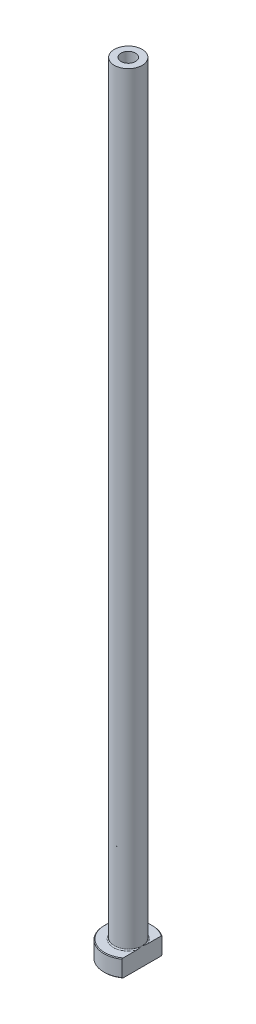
ISO-10303-21;
HEADER;
FILE_DESCRIPTION(('STEP AP214'),'2;1');
FILE_NAME('part.step','',(''),(''),'','','');
FILE_SCHEMA(('AUTOMOTIVE_DESIGN { 1 0 10303 214 1 1 1 1 }'));
ENDSEC;
DATA;
#1=APPLICATION_CONTEXT('core data for automotive mechanical design processes');
#2=APPLICATION_PROTOCOL_DEFINITION('international standard','automotive_design',2000,#1);
#3=PRODUCT_CONTEXT('',#1,'mechanical');
#4=PRODUCT('Part','Part','',(#3));
#5=PRODUCT_RELATED_PRODUCT_CATEGORY('part','',(#4));
#6=PRODUCT_DEFINITION_FORMATION('','',#4);
#7=PRODUCT_DEFINITION_CONTEXT('part definition',#1,'design');
#8=PRODUCT_DEFINITION('design','',#6,#7);
#9=PRODUCT_DEFINITION_SHAPE('','',#8);
#10=(LENGTH_UNIT() NAMED_UNIT(*) SI_UNIT(.MILLI.,.METRE.));
#11=(NAMED_UNIT(*) PLANE_ANGLE_UNIT() SI_UNIT($,.RADIAN.));
#12=(NAMED_UNIT(*) SI_UNIT($,.STERADIAN.) SOLID_ANGLE_UNIT());
#13=UNCERTAINTY_MEASURE_WITH_UNIT(LENGTH_MEASURE(1.E-05),#10,'distance_accuracy_value','');
#14=(GEOMETRIC_REPRESENTATION_CONTEXT(3) GLOBAL_UNCERTAINTY_ASSIGNED_CONTEXT((#13)) GLOBAL_UNIT_ASSIGNED_CONTEXT((#10,
#11,#12)) REPRESENTATION_CONTEXT('',''));
#15=CARTESIAN_POINT('',(0.,0.,0.));
#16=DIRECTION('',(0.,0.,1.));
#17=DIRECTION('',(1.,0.,0.));
#18=AXIS2_PLACEMENT_3D('',#15,#16,#17);
#19=CARTESIAN_POINT('',(0.,92.1876809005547,0.));
#20=DIRECTION('',(0.,1.,0.));
#21=DIRECTION('',(0.,0.,1.));
#22=AXIS2_PLACEMENT_3D('',#19,#20,#21);
#23=CYLINDRICAL_SURFACE('',#22,2.10000000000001);
#24=CARTESIAN_POINT('',(0.,225.,0.));
#25=DIRECTION('',(0.,1.,0.));
#26=DIRECTION('',(0.,0.,1.));
#27=AXIS2_PLACEMENT_3D('',#24,#25,#26);
#28=CIRCLE('',#27,2.10000000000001);
#29=CARTESIAN_POINT('',(0.,225.,2.10000000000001));
#30=VERTEX_POINT('',#29);
#31=EDGE_CURVE('E167',#30,#30,#28,.T.);
#32=ORIENTED_EDGE('',*,*,#31,.T.);
#33=EDGE_LOOP('',(#32));
#34=FACE_BOUND('',#33,.T.);
#35=CARTESIAN_POINT('',(0.,180.,0.));
#36=DIRECTION('',(0.,1.,0.));
#37=DIRECTION('',(0.,0.,1.));
#38=AXIS2_PLACEMENT_3D('',#35,#36,#37);
#39=CIRCLE('',#38,2.10000000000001);
#40=CARTESIAN_POINT('',(0.,180.,2.10000000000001));
#41=VERTEX_POINT('',#40);
#42=EDGE_CURVE('E170',#41,#41,#39,.T.);
#43=ORIENTED_EDGE('',*,*,#42,.F.);
#44=EDGE_LOOP('',(#43));
#45=FACE_BOUND('',#44,.T.);
#46=ADVANCED_FACE('F32',(#34,#45),#23,.F.);
#47=CARTESIAN_POINT('',(-2.10000000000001,225.,0.));
#48=DIRECTION('',(0.,1.,0.));
#49=DIRECTION('',(0.,0.,1.));
#50=AXIS2_PLACEMENT_3D('',#47,#48,#49);
#51=PLANE('',#50);
#52=CARTESIAN_POINT('',(0.,225.,0.));
#53=DIRECTION('',(0.,1.,0.));
#54=DIRECTION('',(0.,0.,1.));
#55=AXIS2_PLACEMENT_3D('',#52,#53,#54);
#56=CIRCLE('',#55,4.00000000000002);
#57=CARTESIAN_POINT('',(0.,225.,4.00000000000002));
#58=VERTEX_POINT('',#57);
#59=EDGE_CURVE('E174',#58,#58,#56,.T.);
#60=ORIENTED_EDGE('',*,*,#59,.T.);
#61=EDGE_LOOP('',(#60));
#62=FACE_BOUND('',#61,.T.);
#63=ORIENTED_EDGE('',*,*,#31,.F.);
#64=EDGE_LOOP('',(#63));
#65=FACE_BOUND('',#64,.T.);
#66=ADVANCED_FACE('F157',(#62,#65),#51,.T.);
#67=CARTESIAN_POINT('',(0.,92.1876809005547,0.));
#68=DIRECTION('',(0.,1.,0.));
#69=DIRECTION('',(0.,0.,1.));
#70=AXIS2_PLACEMENT_3D('',#67,#68,#69);
#71=CYLINDRICAL_SURFACE('',#70,4.);
#72=CARTESIAN_POINT('',(0.,5.3,0.));
#73=DIRECTION('',(0.,1.,0.));
#74=DIRECTION('',(0.,0.,1.));
#75=AXIS2_PLACEMENT_3D('',#72,#73,#74);
#76=CIRCLE('',#75,4.);
#77=CARTESIAN_POINT('',(4.,5.3,0.));
#78=VERTEX_POINT('',#77);
#79=EDGE_CURVE('E180',#78,#78,#76,.T.);
#80=ORIENTED_EDGE('',*,*,#79,.T.);
#81=EDGE_LOOP('',(#80));
#82=FACE_BOUND('',#81,.T.);
#83=ORIENTED_EDGE('',*,*,#59,.F.);
#84=EDGE_LOOP('',(#83));
#85=FACE_BOUND('',#84,.T.);
#86=ADVANCED_FACE('F162',(#82,#85),#71,.T.);
#87=CARTESIAN_POINT('',(-3.99999999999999,5.,0.));
#88=DIRECTION('',(0.,1.,0.));
#89=DIRECTION('',(0.,0.,1.));
#90=AXIS2_PLACEMENT_3D('',#87,#88,#89);
#91=PLANE('',#90);
#92=DIRECTION('',(0.,0.,1.));
#93=VECTOR('',#92,1.);
#94=CARTESIAN_POINT('',(4.,5.,0.));
#95=LINE('',#94,#93);
#96=CARTESIAN_POINT('',(4.,5.,-5.49909083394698));
#97=VERTEX_POINT('',#96);
#98=CARTESIAN_POINT('',(4.,5.,-1.57797338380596));
#99=VERTEX_POINT('',#98);
#100=EDGE_CURVE('E54',#97,#99,#95,.T.);
#101=ORIENTED_EDGE('',*,*,#100,.F.);
#102=CARTESIAN_POINT('',(0.,5.,0.));
#103=DIRECTION('',(0.,1.,0.));
#104=DIRECTION('',(0.,0.,1.));
#105=AXIS2_PLACEMENT_3D('',#102,#103,#104);
#106=CIRCLE('',#105,6.79999999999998);
#107=CARTESIAN_POINT('',(3.99999999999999,5.,5.49909083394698));
#108=VERTEX_POINT('',#107);
#109=EDGE_CURVE('E186',#97,#108,#106,.T.);
#110=ORIENTED_EDGE('',*,*,#109,.T.);
#111=CARTESIAN_POINT('',(4.,5.,1.57797338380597));
#112=VERTEX_POINT('',#111);
#113=EDGE_CURVE('E134',#112,#108,#95,.T.);
#114=ORIENTED_EDGE('',*,*,#113,.F.);
#115=CARTESIAN_POINT('',(0.,5.,0.));
#116=DIRECTION('',(0.,1.,0.));
#117=DIRECTION('',(0.,0.,1.));
#118=AXIS2_PLACEMENT_3D('',#115,#116,#117);
#119=CIRCLE('',#118,4.3);
#120=EDGE_CURVE('E183',#112,#99,#119,.F.);
#121=ORIENTED_EDGE('',*,*,#120,.T.);
#122=EDGE_LOOP('',(#101,#110,#114,#121));
#123=FACE_BOUND('',#122,.T.);
#124=ADVANCED_FACE('F197',(#123),#91,.T.);
#125=CARTESIAN_POINT('',(0.,92.1876809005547,0.));
#126=DIRECTION('',(0.,1.,0.));
#127=DIRECTION('',(0.,0.,1.));
#128=AXIS2_PLACEMENT_3D('',#125,#126,#127);
#129=CYLINDRICAL_SURFACE('',#128,6.99999999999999);
#130=DIRECTION('',(0.,-1.,0.));
#131=VECTOR('',#130,1.);
#132=CARTESIAN_POINT('',(3.99999999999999,225.,5.74456264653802));
#133=LINE('',#132,#131);
#134=CARTESIAN_POINT('',(3.99999999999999,4.79999999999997,5.74456264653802));
#135=VERTEX_POINT('',#134);
#136=CARTESIAN_POINT('',(3.99999999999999,0.20000000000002,5.74456264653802));
#137=VERTEX_POINT('',#136);
#138=EDGE_CURVE('E82',#135,#137,#133,.T.);
#139=ORIENTED_EDGE('',*,*,#138,.F.);
#140=CARTESIAN_POINT('',(0.,4.79999999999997,0.));
#141=DIRECTION('',(0.,1.,0.));
#142=DIRECTION('',(0.,0.,1.));
#143=AXIS2_PLACEMENT_3D('',#140,#141,#142);
#144=CIRCLE('',#143,6.99999999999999);
#145=CARTESIAN_POINT('',(4.,4.79999999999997,-5.74456264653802));
#146=VERTEX_POINT('',#145);
#147=EDGE_CURVE('E95',#135,#146,#144,.F.);
#148=ORIENTED_EDGE('',*,*,#147,.T.);
#149=DIRECTION('',(0.,-1.,0.));
#150=VECTOR('',#149,1.);
#151=CARTESIAN_POINT('',(4.,225.,-5.74456264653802));
#152=LINE('',#151,#150);
#153=CARTESIAN_POINT('',(4.,0.200000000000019,-5.74456264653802));
#154=VERTEX_POINT('',#153);
#155=EDGE_CURVE('E192',#146,#154,#152,.T.);
#156=ORIENTED_EDGE('',*,*,#155,.T.);
#157=CARTESIAN_POINT('',(0.,0.20000000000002,0.));
#158=DIRECTION('',(0.,-1.,0.));
#159=DIRECTION('',(0.,0.,-1.));
#160=AXIS2_PLACEMENT_3D('',#157,#158,#159);
#161=CIRCLE('',#160,6.99999999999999);
#162=EDGE_CURVE('E98',#154,#137,#161,.F.);
#163=ORIENTED_EDGE('',*,*,#162,.T.);
#164=EDGE_LOOP('',(#139,#148,#156,#163));
#165=FACE_BOUND('',#164,.T.);
#166=ADVANCED_FACE('F190',(#165),#129,.T.);
#167=CARTESIAN_POINT('',(-6.99999999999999,0.,0.));
#168=DIRECTION('',(0.,-1.,0.));
#169=DIRECTION('',(0.,0.,-1.));
#170=AXIS2_PLACEMENT_3D('',#167,#168,#169);
#171=PLANE('',#170);
#172=CARTESIAN_POINT('',(0.,0.,0.));
#173=DIRECTION('',(0.,-1.,0.));
#174=DIRECTION('',(0.,0.,-1.));
#175=AXIS2_PLACEMENT_3D('',#172,#173,#174);
#176=CIRCLE('',#175,2.84999999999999);
#177=CARTESIAN_POINT('',(0.,0.,-2.84999999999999));
#178=VERTEX_POINT('',#177);
#179=EDGE_CURVE('E40',#178,#178,#176,.F.);
#180=ORIENTED_EDGE('',*,*,#179,.T.);
#181=EDGE_LOOP('',(#180));
#182=FACE_BOUND('',#181,.T.);
#183=DIRECTION('',(0.,0.,-1.));
#184=VECTOR('',#183,1.);
#185=CARTESIAN_POINT('',(3.99999999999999,0.,5.74456264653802));
#186=LINE('',#185,#184);
#187=CARTESIAN_POINT('',(3.99999999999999,0.,5.49909083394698));
#188=VERTEX_POINT('',#187);
#189=CARTESIAN_POINT('',(4.,0.,-5.49909083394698));
#190=VERTEX_POINT('',#189);
#191=EDGE_CURVE('E47',#188,#190,#186,.T.);
#192=ORIENTED_EDGE('',*,*,#191,.F.);
#193=CARTESIAN_POINT('',(0.,0.,0.));
#194=DIRECTION('',(0.,-1.,0.));
#195=DIRECTION('',(0.,0.,-1.));
#196=AXIS2_PLACEMENT_3D('',#193,#194,#195);
#197=CIRCLE('',#196,6.79999999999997);
#198=EDGE_CURVE('E92',#188,#190,#197,.T.);
#199=ORIENTED_EDGE('',*,*,#198,.T.);
#200=EDGE_LOOP('',(#192,#199));
#201=FACE_BOUND('',#200,.T.);
#202=ADVANCED_FACE('F91',(#182,#201),#171,.T.);
#203=CARTESIAN_POINT('',(0.,92.1876809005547,0.));
#204=DIRECTION('',(0.,1.,0.));
#205=DIRECTION('',(0.,0.,1.));
#206=AXIS2_PLACEMENT_3D('',#203,#204,#205);
#207=CYLINDRICAL_SURFACE('',#206,2.35);
#208=CARTESIAN_POINT('',(0.,0.499999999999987,0.));
#209=DIRECTION('',(0.,-1.,0.));
#210=DIRECTION('',(0.,0.,-1.));
#211=AXIS2_PLACEMENT_3D('',#208,#209,#210);
#212=CIRCLE('',#211,2.35);
#213=CARTESIAN_POINT('',(0.,0.499999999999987,-2.35));
#214=VERTEX_POINT('',#213);
#215=EDGE_CURVE('E11',#214,#214,#212,.T.);
#216=ORIENTED_EDGE('',*,*,#215,.T.);
#217=EDGE_LOOP('',(#216));
#218=FACE_BOUND('',#217,.T.);
#219=CARTESIAN_POINT('',(0.,168.,0.));
#220=DIRECTION('',(0.,1.,0.));
#221=DIRECTION('',(0.,0.,1.));
#222=AXIS2_PLACEMENT_3D('',#219,#220,#221);
#223=CIRCLE('',#222,2.35000000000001);
#224=CARTESIAN_POINT('',(0.,168.,2.35000000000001));
#225=VERTEX_POINT('',#224);
#226=EDGE_CURVE('E172',#225,#225,#223,.T.);
#227=ORIENTED_EDGE('',*,*,#226,.T.);
#228=EDGE_LOOP('',(#227));
#229=FACE_BOUND('',#228,.T.);
#230=ADVANCED_FACE('F215',(#218,#229),#207,.F.);
#231=CARTESIAN_POINT('',(0.,168.,0.));
#232=DIRECTION('',(0.,-1.,0.));
#233=DIRECTION('',(0.,0.,-1.));
#234=AXIS2_PLACEMENT_3D('',#231,#232,#233);
#235=CONICAL_SURFACE('',#234,2.35000000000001,0.0208303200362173);
#236=ORIENTED_EDGE('',*,*,#42,.T.);
#237=EDGE_LOOP('',(#236));
#238=FACE_BOUND('',#237,.T.);
#239=ORIENTED_EDGE('',*,*,#226,.F.);
#240=EDGE_LOOP('',(#239));
#241=FACE_BOUND('',#240,.T.);
#242=ADVANCED_FACE('F111',(#238,#241),#235,.F.);
#243=CARTESIAN_POINT('',(0.,5.3,0.));
#244=DIRECTION('',(0.,1.,0.));
#245=DIRECTION('',(0.,0.,1.));
#246=AXIS2_PLACEMENT_3D('',#243,#244,#245);
#247=TOROIDAL_SURFACE('',#246,4.3,0.3);
#248=ORIENTED_EDGE('',*,*,#120,.F.);
#249=CARTESIAN_POINT('',(4.,5.3,0.));
#250=CARTESIAN_POINT('',(4.,5.3000006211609,-1.06261402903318E-10));
#251=CARTESIAN_POINT('',(4.,5.30000124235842,2.17726115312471E-07));
#252=CARTESIAN_POINT('',(4.,5.30000240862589,8.3614111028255E-07));
#253=CARTESIAN_POINT('',(4.,5.30000294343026,1.25011693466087E-06));
#254=CARTESIAN_POINT('',(4.,5.30000404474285,2.23959355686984E-06));
#255=CARTESIAN_POINT('',(4.,5.30000459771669,2.83084484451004E-06));
#256=CARTESIAN_POINT('',(4.,5.30000559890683,4.06516628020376E-06));
#257=CARTESIAN_POINT('',(4.,5.30000604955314,4.70640106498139E-06));
#258=CARTESIAN_POINT('',(4.,5.30000769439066,7.15677247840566E-06));
#259=CARTESIAN_POINT('',(4.,5.30000879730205,9.02996026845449E-06));
#260=CARTESIAN_POINT('',(4.,5.30001063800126,1.27664892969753E-05));
#261=CARTESIAN_POINT('',(4.,5.30001139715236,1.46197811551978E-05));
#262=CARTESIAN_POINT('',(4.,5.30001453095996,2.23679231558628E-05));
#263=CARTESIAN_POINT('',(4.,5.30001683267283,2.829687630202E-05));
#264=CARTESIAN_POINT('',(4.,5.30002027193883,3.95668745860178E-05));
#265=CARTESIAN_POINT('',(4.,5.30002152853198,4.487154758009E-05));
#266=CARTESIAN_POINT('',(4.,5.3000306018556,8.40118223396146E-05));
#267=CARTESIAN_POINT('',(4.,5.30003739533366,0.00011802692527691));
#268=CARTESIAN_POINT('',(3.99999999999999,5.30006713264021,0.000252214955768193));
#269=CARTESIAN_POINT('',(3.99999999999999,5.30009559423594,0.000351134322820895));
#270=CARTESIAN_POINT('',(4.,5.30020622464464,0.000742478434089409));
#271=CARTESIAN_POINT('',(4.,5.30028475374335,0.00103561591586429));
#272=CARTESIAN_POINT('',(3.99999999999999,5.30059889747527,0.00219920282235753));
#273=CARTESIAN_POINT('',(3.99999999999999,5.30083905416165,0.00306873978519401));
#274=CARTESIAN_POINT('',(4.,5.30183682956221,0.00669141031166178));
#275=CARTESIAN_POINT('',(4.,5.30258877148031,0.0094456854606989));
#276=CARTESIAN_POINT('',(3.99999999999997,5.31066890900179,0.0390293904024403));
#277=CARTESIAN_POINT('',(3.99999999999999,5.31802631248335,0.0658531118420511));
#278=CARTESIAN_POINT('',(4.,5.33239676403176,0.11844192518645));
#279=CARTESIAN_POINT('',(4.,5.33941183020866,0.144206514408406));
#280=CARTESIAN_POINT('',(3.99999999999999,5.35427366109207,0.199017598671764));
#281=CARTESIAN_POINT('',(3.99999999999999,5.362113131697,0.228066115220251));
#282=CARTESIAN_POINT('',(4.,5.37776349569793,0.286511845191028));
#283=CARTESIAN_POINT('',(4.,5.38557313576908,0.31590939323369));
#284=CARTESIAN_POINT('',(4.,5.40425662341,0.386994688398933));
#285=CARTESIAN_POINT('',(4.,5.4150523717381,0.4287031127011));
#286=CARTESIAN_POINT('',(4.,5.43592310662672,0.511098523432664));
#287=CARTESIAN_POINT('',(4.,5.44600969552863,0.551782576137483));
#288=CARTESIAN_POINT('',(4.,5.47850986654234,0.686599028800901));
#289=CARTESIAN_POINT('',(4.,5.49978370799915,0.781011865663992));
#290=CARTESIAN_POINT('',(4.,5.53807543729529,0.971847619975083));
#291=CARTESIAN_POINT('',(4.,5.55504273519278,1.06828120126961));
#292=CARTESIAN_POINT('',(4.,5.57582405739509,1.21752725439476));
#293=CARTESIAN_POINT('',(4.,5.5820979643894,1.26999379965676));
#294=CARTESIAN_POINT('',(4.,5.59210686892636,1.37516324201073));
#295=CARTESIAN_POINT('',(4.,5.59584265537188,1.42786606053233));
#296=CARTESIAN_POINT('',(4.,5.60010438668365,1.53310673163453));
#297=CARTESIAN_POINT('',(4.,5.6006487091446,1.58564378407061));
#298=CARTESIAN_POINT('',(4.,5.59767158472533,1.69058605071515));
#299=CARTESIAN_POINT('',(4.,5.59415502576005,1.74299134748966));
#300=CARTESIAN_POINT('',(4.,5.58503062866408,1.81903290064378));
#301=CARTESIAN_POINT('',(4.,5.58157617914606,1.84292934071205));
#302=CARTESIAN_POINT('',(4.,5.57329952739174,1.89051061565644));
#303=CARTESIAN_POINT('',(4.,5.56847619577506,1.91419525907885));
#304=CARTESIAN_POINT('',(4.,5.55726644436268,1.96092888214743));
#305=CARTESIAN_POINT('',(4.,5.55089740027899,1.98398195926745));
#306=CARTESIAN_POINT('',(4.,5.53623434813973,2.02945550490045));
#307=CARTESIAN_POINT('',(4.,5.52794253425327,2.05187666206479));
#308=CARTESIAN_POINT('',(4.,5.50887098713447,2.09590631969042));
#309=CARTESIAN_POINT('',(4.,5.49806837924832,2.11750508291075));
#310=CARTESIAN_POINT('',(4.,5.47333401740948,2.15885583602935));
#311=CARTESIAN_POINT('',(4.,5.45941272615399,2.17861369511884));
#312=CARTESIAN_POINT('',(4.,5.43588221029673,2.20522942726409));
#313=CARTESIAN_POINT('',(4.,5.42781139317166,2.21344043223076));
#314=CARTESIAN_POINT('',(4.,5.41065114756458,2.22875149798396));
#315=CARTESIAN_POINT('',(4.,5.4015612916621,2.23585108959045));
#316=CARTESIAN_POINT('',(4.,5.38220524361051,2.24859694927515));
#317=CARTESIAN_POINT('',(4.,5.37192420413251,2.25422119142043));
#318=CARTESIAN_POINT('',(4.,5.3504507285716,2.26331064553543));
#319=CARTESIAN_POINT('',(4.,5.33926122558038,2.26678251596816));
#320=CARTESIAN_POINT('',(4.,5.31952044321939,2.2705126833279));
#321=CARTESIAN_POINT('',(4.,5.31108453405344,2.27139016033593));
#322=CARTESIAN_POINT('',(4.,5.29418624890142,2.27168963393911));
#323=CARTESIAN_POINT('',(4.,5.2857238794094,2.27111196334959));
#324=CARTESIAN_POINT('',(4.,5.269041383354,2.26855580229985));
#325=CARTESIAN_POINT('',(4.,5.26082066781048,2.26658107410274));
#326=CARTESIAN_POINT('',(4.,5.24478214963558,2.26139496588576));
#327=CARTESIAN_POINT('',(4.,5.23696461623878,2.25818277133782));
#328=CARTESIAN_POINT('',(4.,5.2185123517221,2.24908332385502));
#329=CARTESIAN_POINT('',(4.,5.20815219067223,2.24264095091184));
#330=CARTESIAN_POINT('',(4.,5.18857975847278,2.22819957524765));
#331=CARTESIAN_POINT('',(4.,5.17937061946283,2.22019647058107));
#332=CARTESIAN_POINT('',(4.,5.15665383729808,2.19777756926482));
#333=CARTESIAN_POINT('',(4.,5.14403484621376,2.18246908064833));
#334=CARTESIAN_POINT('',(4.,5.12118369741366,2.15020843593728));
#335=CARTESIAN_POINT('',(4.,5.11095480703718,2.13325407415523));
#336=CARTESIAN_POINT('',(4.,5.09273574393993,2.09892324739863));
#337=CARTESIAN_POINT('',(4.,5.08468212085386,2.0815798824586));
#338=CARTESIAN_POINT('',(4.,5.07005901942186,2.04627072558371));
#339=CARTESIAN_POINT('',(4.,5.06349101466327,2.02830433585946));
#340=CARTESIAN_POINT('',(4.,5.04555485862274,1.97350761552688));
#341=CARTESIAN_POINT('',(4.,5.0360897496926,1.93605770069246));
#342=CARTESIAN_POINT('',(4.,5.01780569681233,1.84529235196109));
#343=CARTESIAN_POINT('',(4.,5.01077018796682,1.79164082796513));
#344=CARTESIAN_POINT('',(4.,5.00182846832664,1.68379947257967));
#345=CARTESIAN_POINT('',(4.,4.99993887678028,1.62960846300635));
#346=CARTESIAN_POINT('',(4.,5.00006129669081,1.52361204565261));
#347=CARTESIAN_POINT('',(4.,5.00190698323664,1.47180551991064));
#348=CARTESIAN_POINT('',(4.,5.00841243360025,1.36835357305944));
#349=CARTESIAN_POINT('',(4.,5.01307376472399,1.31670825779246));
#350=CARTESIAN_POINT('',(4.,5.02905484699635,1.17431887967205));
#351=CARTESIAN_POINT('',(4.,5.04274090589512,1.08384207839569));
#352=CARTESIAN_POINT('',(4.,5.06701714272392,0.947757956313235));
#353=CARTESIAN_POINT('',(4.,5.07585573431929,0.901814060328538));
#354=CARTESIAN_POINT('',(4.,5.09458665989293,0.810008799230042));
#355=CARTESIAN_POINT('',(4.,5.1044818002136,0.76414800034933));
#356=CARTESIAN_POINT('',(4.,5.12892434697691,0.655631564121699));
#357=CARTESIAN_POINT('',(4.,5.14383556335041,0.593058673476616));
#358=CARTESIAN_POINT('',(3.99999999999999,5.17458762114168,0.468885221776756));
#359=CARTESIAN_POINT('',(3.99999999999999,5.19041623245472,0.407281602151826));
#360=CARTESIAN_POINT('',(4.,5.22090834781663,0.291232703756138));
#361=CARTESIAN_POINT('',(4.00000000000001,5.23550024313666,0.236768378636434));
#362=CARTESIAN_POINT('',(3.99999999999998,5.26562550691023,0.125604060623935));
#363=CARTESIAN_POINT('',(3.99999999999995,5.28117250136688,0.0689076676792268));
#364=CARTESIAN_POINT('',(4.,5.29741226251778,0.00944154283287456));
#365=CARTESIAN_POINT('',(4.,5.29816540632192,0.00668315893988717));
#366=CARTESIAN_POINT('',(3.99999999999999,5.29916346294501,0.00305954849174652));
#367=CARTESIAN_POINT('',(3.99999999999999,5.29940273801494,0.00219318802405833));
#368=CARTESIAN_POINT('',(4.,5.29971580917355,0.00103357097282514));
#369=CARTESIAN_POINT('',(4.,5.29979412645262,0.000741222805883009));
#370=CARTESIAN_POINT('',(3.99999999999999,5.29990450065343,0.000350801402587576));
#371=CARTESIAN_POINT('',(3.99999999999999,5.29993292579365,0.000252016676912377));
#372=CARTESIAN_POINT('',(4.,5.29996263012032,0.000117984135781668));
#373=CARTESIAN_POINT('',(4.,5.29996941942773,8.39881915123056E-05));
#374=CARTESIAN_POINT('',(4.,5.29997848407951,4.48674025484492E-05));
#375=CARTESIAN_POINT('',(4.,5.29997973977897,3.95638200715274E-05));
#376=CARTESIAN_POINT('',(4.,5.2999831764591,2.82960347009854E-05));
#377=CARTESIAN_POINT('',(4.,5.29998547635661,2.23681462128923E-05));
#378=CARTESIAN_POINT('',(4.,5.29998860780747,1.46211004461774E-05));
#379=CARTESIAN_POINT('',(4.,5.29998936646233,1.27678902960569E-05));
#380=CARTESIAN_POINT('',(4.,5.29999120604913,9.03144078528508E-06));
#381=CARTESIAN_POINT('',(4.,5.29999230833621,7.15824106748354E-06));
#382=CARTESIAN_POINT('',(4.,5.29999395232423,4.70775534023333E-06));
#383=CARTESIAN_POINT('',(4.,5.29999440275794,4.06646398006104E-06));
#384=CARTESIAN_POINT('',(4.,5.29999540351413,2.8319910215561E-06));
#385=CARTESIAN_POINT('',(4.,5.29999595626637,2.24064356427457E-06));
#386=CARTESIAN_POINT('',(4.,5.29999705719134,1.25093982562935E-06));
#387=CARTESIAN_POINT('',(4.,5.29999759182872,8.36841164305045E-07));
#388=CARTESIAN_POINT('',(4.,5.29999875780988,2.18117796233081E-07));
#389=CARTESIAN_POINT('',(4.,5.29999937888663,1.06254479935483E-10));
#390=CARTESIAN_POINT('',(4.,5.3,0.));
#391=B_SPLINE_CURVE_WITH_KNOTS('',3,(#249,#250,#251,#252,#253,#254,#255,#256,#257,#258,#259,
#260,#261,#262,#263,#264,#265,#266,#267,#268,#269,#270,#271,#272,#273,#274,#275,#276,#277,#278,
#279,#280,#281,#282,#283,#284,#285,#286,#287,#288,#289,#290,#291,#292,#293,#294,#295,#296,#297,
#298,#299,#300,#301,#302,#303,#304,#305,#306,#307,#308,#309,#310,#311,#312,#313,#314,#315,#316,
#317,#318,#319,#320,#321,#322,#323,#324,#325,#326,#327,#328,#329,#330,#331,#332,#333,#334,#335,
#336,#337,#338,#339,#340,#341,#342,#343,#344,#345,#346,#347,#348,#349,#350,#351,#352,#353,#354,
#355,#356,#357,#358,#359,#360,#361,#362,#363,#364,#365,#366,#367,#368,#369,#370,#371,#372,#373,
#374,#375,#376,#377,#378,#379,#380,#381,#382,#383,#384,#385,#386,#387,#388,#389,#390),
.UNSPECIFIED.,.T.,.F.,(4,2,2,2,2,2,2,2,2,2,2,2,2,2,2,2,2,2,2,2,2,2,2,2,2,2,2,2,2,2,2,2,2,2,2,2,
2,2,2,2,2,2,2,2,2,2,2,2,2,2,2,2,2,2,2,2,2,2,2,2,2,2,2,2,2,2,2,2,2,2,4),(0.,1.87484377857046E-06,
3.90179959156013E-06,6.31683762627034E-06,8.66651882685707E-06,1.51627545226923E-05,
2.11657921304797E-05,4.02090766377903E-05,5.65429458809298E-05,0.000160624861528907,
0.000469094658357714,0.00137985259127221,0.00408571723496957,0.012651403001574,
0.0960918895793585,0.17620014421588,0.266463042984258,0.357714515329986,0.486961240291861,
0.612707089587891,0.90298810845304,1.19653589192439,1.35501075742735,1.51343634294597,
1.67094875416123,1.82827177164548,1.90067591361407,1.97313996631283,2.04482437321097,
2.11642737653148,2.18871023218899,2.26075412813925,2.29521947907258,2.3296993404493,
2.36466792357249,2.39952778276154,2.42485422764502,2.45017488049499,2.47542760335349,
2.50069697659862,2.53708899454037,2.57357798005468,2.63276032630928,2.69202310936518,
2.74930315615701,2.80663977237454,2.92223125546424,3.08420752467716,3.24670629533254,
3.40212850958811,3.5576373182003,3.83192962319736,3.97228382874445,4.11302057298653,
4.3059813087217,4.49678885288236,4.66594443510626,4.84230602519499,4.85088453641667,
4.85358051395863,4.85448881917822,4.85479687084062,4.85490089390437,4.8549172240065,
4.85493626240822,4.85494226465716,4.85494875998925,4.85495110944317,4.85495352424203,
4.85495555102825,4.85495742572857),.UNSPECIFIED.);
#392=EDGE_CURVE('E126',#112,#78,#391,.T.);
#393=ORIENTED_EDGE('',*,*,#392,.T.);
#394=ORIENTED_EDGE('',*,*,#79,.F.);
#395=CARTESIAN_POINT('',(4.,5.3,0.));
#396=CARTESIAN_POINT('',(4.,5.2999993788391,1.06262606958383E-10));
#397=CARTESIAN_POINT('',(4.,5.29999875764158,-2.17726114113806E-07));
#398=CARTESIAN_POINT('',(4.,5.29999759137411,-8.36141109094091E-07));
#399=CARTESIAN_POINT('',(4.,5.29999705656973,-1.25011693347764E-06));
#400=CARTESIAN_POINT('',(4.,5.29999595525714,-2.23959355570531E-06));
#401=CARTESIAN_POINT('',(4.,5.29999540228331,-2.8308448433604E-06));
#402=CARTESIAN_POINT('',(4.,5.29999440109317,-4.06516627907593E-06));
#403=CARTESIAN_POINT('',(4.,5.29999395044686,-4.70640106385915E-06));
#404=CARTESIAN_POINT('',(4.,5.29999230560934,-7.15677247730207E-06));
#405=CARTESIAN_POINT('',(4.,5.29999120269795,-9.02996026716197E-06));
#406=CARTESIAN_POINT('',(4.,5.29998936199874,-1.27664892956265E-05));
#407=CARTESIAN_POINT('',(4.,5.29998860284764,-1.4619781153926E-05));
#408=CARTESIAN_POINT('',(4.,5.29998546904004,-2.2367923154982E-05));
#409=CARTESIAN_POINT('',(4.,5.29998316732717,-2.8296876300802E-05));
#410=CARTESIAN_POINT('',(4.,5.29997972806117,-3.95668745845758E-05));
#411=CARTESIAN_POINT('',(4.,5.29997847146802,-4.48715475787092E-05));
#412=CARTESIAN_POINT('',(4.,5.2999693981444,-8.40118223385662E-05));
#413=CARTESIAN_POINT('',(4.,5.29996260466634,-0.000118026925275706));
#414=CARTESIAN_POINT('',(3.99999999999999,5.29993286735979,-0.000252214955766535));
#415=CARTESIAN_POINT('',(3.99999999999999,5.29990440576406,-0.000351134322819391));
#416=CARTESIAN_POINT('',(4.,5.29979377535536,-0.000742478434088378));
#417=CARTESIAN_POINT('',(4.,5.29971524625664,-0.00103561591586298));
#418=CARTESIAN_POINT('',(3.99999999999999,5.29940110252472,-0.00219920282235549));
#419=CARTESIAN_POINT('',(3.99999999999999,5.29916094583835,-0.00306873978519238));
#420=CARTESIAN_POINT('',(4.,5.29816317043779,-0.00669141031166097));
#421=CARTESIAN_POINT('',(4.,5.29741122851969,-0.00944568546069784));
#422=CARTESIAN_POINT('',(3.99999999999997,5.28933109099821,-0.039029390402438));
#423=CARTESIAN_POINT('',(3.99999999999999,5.28197368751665,-0.0658531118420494));
#424=CARTESIAN_POINT('',(4.,5.26760323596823,-0.118441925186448));
#425=CARTESIAN_POINT('',(4.,5.26058816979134,-0.144206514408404));
#426=CARTESIAN_POINT('',(3.99999999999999,5.24572633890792,-0.199017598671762));
#427=CARTESIAN_POINT('',(3.99999999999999,5.23788686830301,-0.228066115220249));
#428=CARTESIAN_POINT('',(4.,5.22223650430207,-0.286511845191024));
#429=CARTESIAN_POINT('',(4.,5.21442686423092,-0.315909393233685));
#430=CARTESIAN_POINT('',(4.,5.19574337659,-0.386994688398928));
#431=CARTESIAN_POINT('',(4.,5.1849476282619,-0.428703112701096));
#432=CARTESIAN_POINT('',(4.,5.16407689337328,-0.511098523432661));
#433=CARTESIAN_POINT('',(4.,5.15399030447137,-0.551782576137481));
#434=CARTESIAN_POINT('',(4.,5.12149013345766,-0.686599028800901));
#435=CARTESIAN_POINT('',(4.,5.10021629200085,-0.781011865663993));
#436=CARTESIAN_POINT('',(4.,5.06192456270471,-0.971847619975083));
#437=CARTESIAN_POINT('',(4.,5.04495726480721,-1.06828120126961));
#438=CARTESIAN_POINT('',(4.,5.02417594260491,-1.21752725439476));
#439=CARTESIAN_POINT('',(4.,5.0179020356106,-1.26999379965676));
#440=CARTESIAN_POINT('',(4.,5.00789313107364,-1.37516324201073));
#441=CARTESIAN_POINT('',(4.,5.00415734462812,-1.42786606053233));
#442=CARTESIAN_POINT('',(4.,4.99989561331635,-1.53310673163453));
#443=CARTESIAN_POINT('',(4.,4.9993512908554,-1.58564378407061));
#444=CARTESIAN_POINT('',(4.,5.00232841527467,-1.69058605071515));
#445=CARTESIAN_POINT('',(4.,5.00584497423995,-1.74299134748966));
#446=CARTESIAN_POINT('',(4.,5.01496937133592,-1.81903290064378));
#447=CARTESIAN_POINT('',(4.,5.01842382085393,-1.84292934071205));
#448=CARTESIAN_POINT('',(4.,5.02670047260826,-1.89051061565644));
#449=CARTESIAN_POINT('',(4.,5.03152380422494,-1.91419525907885));
#450=CARTESIAN_POINT('',(4.,5.04273355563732,-1.96092888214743));
#451=CARTESIAN_POINT('',(4.,5.049102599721,-1.98398195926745));
#452=CARTESIAN_POINT('',(4.,5.06376565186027,-2.02945550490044));
#453=CARTESIAN_POINT('',(4.,5.07205746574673,-2.05187666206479));
#454=CARTESIAN_POINT('',(4.,5.09112901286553,-2.09590631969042));
#455=CARTESIAN_POINT('',(4.,5.10193162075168,-2.11750508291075));
#456=CARTESIAN_POINT('',(4.,5.12666598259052,-2.15885583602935));
#457=CARTESIAN_POINT('',(4.,5.14058727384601,-2.17861369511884));
#458=CARTESIAN_POINT('',(4.,5.16411778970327,-2.20522942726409));
#459=CARTESIAN_POINT('',(4.,5.17218860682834,-2.21344043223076));
#460=CARTESIAN_POINT('',(4.,5.18934885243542,-2.22875149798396));
#461=CARTESIAN_POINT('',(4.,5.1984387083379,-2.23585108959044));
#462=CARTESIAN_POINT('',(4.,5.21779475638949,-2.24859694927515));
#463=CARTESIAN_POINT('',(4.,5.22807579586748,-2.25422119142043));
#464=CARTESIAN_POINT('',(4.,5.24954927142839,-2.26331064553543));
#465=CARTESIAN_POINT('',(4.,5.26073877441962,-2.26678251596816));
#466=CARTESIAN_POINT('',(4.,5.2804795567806,-2.2705126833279));
#467=CARTESIAN_POINT('',(4.,5.28891546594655,-2.27139016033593));
#468=CARTESIAN_POINT('',(4.,5.30581375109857,-2.27168963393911));
#469=CARTESIAN_POINT('',(4.,5.3142761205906,-2.27111196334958));
#470=CARTESIAN_POINT('',(4.,5.330958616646,-2.26855580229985));
#471=CARTESIAN_POINT('',(4.,5.33917933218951,-2.26658107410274));
#472=CARTESIAN_POINT('',(4.,5.35521785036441,-2.26139496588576));
#473=CARTESIAN_POINT('',(4.,5.36303538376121,-2.25818277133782));
#474=CARTESIAN_POINT('',(4.,5.3814876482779,-2.24908332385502));
#475=CARTESIAN_POINT('',(4.,5.39184780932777,-2.24264095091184));
#476=CARTESIAN_POINT('',(4.,5.41142024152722,-2.22819957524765));
#477=CARTESIAN_POINT('',(4.,5.42062938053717,-2.22019647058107));
#478=CARTESIAN_POINT('',(4.,5.44334616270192,-2.19777756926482));
#479=CARTESIAN_POINT('',(4.,5.45596515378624,-2.18246908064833));
#480=CARTESIAN_POINT('',(4.,5.47881630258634,-2.15020843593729));
#481=CARTESIAN_POINT('',(4.,5.48904519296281,-2.13325407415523));
#482=CARTESIAN_POINT('',(4.,5.50726425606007,-2.09892324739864));
#483=CARTESIAN_POINT('',(4.,5.51531787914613,-2.0815798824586));
#484=CARTESIAN_POINT('',(4.,5.52994098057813,-2.04627072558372));
#485=CARTESIAN_POINT('',(4.,5.53650898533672,-2.02830433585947));
#486=CARTESIAN_POINT('',(4.,5.55444514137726,-1.97350761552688));
#487=CARTESIAN_POINT('',(4.,5.5639102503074,-1.93605770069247));
#488=CARTESIAN_POINT('',(4.,5.58219430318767,-1.8452923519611));
#489=CARTESIAN_POINT('',(4.,5.58922981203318,-1.79164082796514));
#490=CARTESIAN_POINT('',(4.,5.59817153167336,-1.68379947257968));
#491=CARTESIAN_POINT('',(4.,5.60006112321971,-1.62960846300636));
#492=CARTESIAN_POINT('',(4.,5.59993870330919,-1.52361204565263));
#493=CARTESIAN_POINT('',(4.,5.59809301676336,-1.47180551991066));
#494=CARTESIAN_POINT('',(4.,5.59158756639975,-1.36835357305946));
#495=CARTESIAN_POINT('',(4.,5.58692623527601,-1.31670825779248));
#496=CARTESIAN_POINT('',(4.,5.57094515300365,-1.17431887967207));
#497=CARTESIAN_POINT('',(4.,5.55725909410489,-1.08384207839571));
#498=CARTESIAN_POINT('',(4.,5.53298285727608,-0.947757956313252));
#499=CARTESIAN_POINT('',(4.,5.52414426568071,-0.901814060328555));
#500=CARTESIAN_POINT('',(4.,5.50541334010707,-0.810008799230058));
#501=CARTESIAN_POINT('',(4.,5.4955181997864,-0.764148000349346));
#502=CARTESIAN_POINT('',(4.,5.47107565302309,-0.655631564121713));
#503=CARTESIAN_POINT('',(4.,5.4561644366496,-0.593058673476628));
#504=CARTESIAN_POINT('',(3.99999999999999,5.42541237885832,-0.468885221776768));
#505=CARTESIAN_POINT('',(3.99999999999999,5.40958376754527,-0.407281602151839));
#506=CARTESIAN_POINT('',(4.,5.37909165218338,-0.291232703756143));
#507=CARTESIAN_POINT('',(4.00000000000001,5.36449975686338,-0.23676837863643));
#508=CARTESIAN_POINT('',(3.99999999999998,5.33437449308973,-0.125604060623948));
#509=CARTESIAN_POINT('',(3.99999999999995,5.31882749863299,-0.0689076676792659));
#510=CARTESIAN_POINT('',(4.,5.30258773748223,-0.00944154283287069));
#511=CARTESIAN_POINT('',(4.,5.30183459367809,-0.0066831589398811));
#512=CARTESIAN_POINT('',(3.99999999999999,5.30083653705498,-0.00305954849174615));
#513=CARTESIAN_POINT('',(3.99999999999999,5.30059726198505,-0.00219318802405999));
#514=CARTESIAN_POINT('',(4.,5.30028419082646,-0.0010335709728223));
#515=CARTESIAN_POINT('',(4.,5.30020587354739,-0.000741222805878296));
#516=CARTESIAN_POINT('',(3.99999999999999,5.30009549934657,-0.000350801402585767));
#517=CARTESIAN_POINT('',(3.99999999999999,5.30006707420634,-0.000252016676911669));
#518=CARTESIAN_POINT('',(4.,5.30003736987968,-0.000117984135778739));
#519=CARTESIAN_POINT('',(4.,5.30003058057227,-8.39881915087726E-05));
#520=CARTESIAN_POINT('',(4.,5.30002151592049,-4.48674025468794E-05));
#521=CARTESIAN_POINT('',(4.,5.30002026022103,-3.95638200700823E-05));
#522=CARTESIAN_POINT('',(4.,5.3000168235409,-2.82960346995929E-05));
#523=CARTESIAN_POINT('',(4.,5.30001452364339,-2.23681462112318E-05));
#524=CARTESIAN_POINT('',(4.,5.30001139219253,-1.46211004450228E-05));
#525=CARTESIAN_POINT('',(4.,5.30001063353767,-1.2767890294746E-05));
#526=CARTESIAN_POINT('',(4.,5.30000879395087,-9.03144078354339E-06));
#527=CARTESIAN_POINT('',(4.,5.30000769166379,-7.15824106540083E-06));
#528=CARTESIAN_POINT('',(4.,5.30000604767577,-4.70775533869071E-06));
#529=CARTESIAN_POINT('',(4.,5.30000559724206,-4.06646397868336E-06));
#530=CARTESIAN_POINT('',(4.,5.30000459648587,-2.83199102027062E-06));
#531=CARTESIAN_POINT('',(4.,5.30000404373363,-2.24064356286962E-06));
#532=CARTESIAN_POINT('',(4.,5.30000294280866,-1.25093982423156E-06));
#533=CARTESIAN_POINT('',(4.,5.30000240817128,-8.36841162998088E-07));
#534=CARTESIAN_POINT('',(4.,5.30000124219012,-2.18117795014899E-07));
#535=CARTESIAN_POINT('',(4.,5.30000062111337,-1.0625326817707E-10));
#536=CARTESIAN_POINT('',(4.,5.3,0.));
#537=B_SPLINE_CURVE_WITH_KNOTS('',3,(#395,#396,#397,#398,#399,#400,#401,#402,#403,#404,#405,
#406,#407,#408,#409,#410,#411,#412,#413,#414,#415,#416,#417,#418,#419,#420,#421,#422,#423,#424,
#425,#426,#427,#428,#429,#430,#431,#432,#433,#434,#435,#436,#437,#438,#439,#440,#441,#442,#443,
#444,#445,#446,#447,#448,#449,#450,#451,#452,#453,#454,#455,#456,#457,#458,#459,#460,#461,#462,
#463,#464,#465,#466,#467,#468,#469,#470,#471,#472,#473,#474,#475,#476,#477,#478,#479,#480,#481,
#482,#483,#484,#485,#486,#487,#488,#489,#490,#491,#492,#493,#494,#495,#496,#497,#498,#499,#500,
#501,#502,#503,#504,#505,#506,#507,#508,#509,#510,#511,#512,#513,#514,#515,#516,#517,#518,#519,
#520,#521,#522,#523,#524,#525,#526,#527,#528,#529,#530,#531,#532,#533,#534,#535,#536),
.UNSPECIFIED.,.T.,.F.,(4,2,2,2,2,2,2,2,2,2,2,2,2,2,2,2,2,2,2,2,2,2,2,2,2,2,2,2,2,2,2,2,2,2,2,2,
2,2,2,2,2,2,2,2,2,2,2,2,2,2,2,2,2,2,2,2,2,2,2,2,2,2,2,2,2,2,2,2,2,2,4),(0.,1.87484377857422E-06,
3.90179959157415E-06,6.31683762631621E-06,8.6665188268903E-06,1.51627545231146E-05,
2.11657921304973E-05,4.02090766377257E-05,5.65429458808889E-05,0.000160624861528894,
0.00046909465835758,0.00137985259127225,0.00408571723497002,0.012651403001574,
0.0960918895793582,0.176200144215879,0.266463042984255,0.357714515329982,0.486961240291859,
0.612707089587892,0.902988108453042,1.19653589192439,1.35501075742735,1.51343634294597,
1.67094875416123,1.82827177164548,1.90067591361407,1.97313996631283,2.04482437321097,
2.11642737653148,2.18871023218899,2.26075412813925,2.29521947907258,2.32969934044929,
2.36466792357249,2.39952778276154,2.42485422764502,2.45017488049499,2.47542760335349,
2.50069697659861,2.53708899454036,2.57357798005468,2.63276032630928,2.69202310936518,
2.749303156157,2.80663977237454,2.92223125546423,3.08420752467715,3.24670629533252,
3.40212850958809,3.55763731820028,3.83192962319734,3.97228382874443,4.11302057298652,
4.30598130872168,4.49678885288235,4.66594443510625,4.84230602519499,4.85088453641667,
4.85358051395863,4.85448881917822,4.85479687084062,4.85490089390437,4.8549172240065,
4.85493626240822,4.85494226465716,4.85494875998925,4.85495110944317,4.85495352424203,
4.85495555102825,4.85495742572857),.UNSPECIFIED.);
#538=EDGE_CURVE('E135',#78,#99,#537,.T.);
#539=ORIENTED_EDGE('',*,*,#538,.T.);
#540=EDGE_LOOP('',(#248,#393,#394,#539));
#541=FACE_BOUND('',#540,.T.);
#542=ADVANCED_FACE('F141',(#541),#247,.F.);
#543=CARTESIAN_POINT('',(0.,5.,0.));
#544=DIRECTION('',(0.,-1.,0.));
#545=DIRECTION('',(0.,0.,-1.));
#546=AXIS2_PLACEMENT_3D('',#543,#544,#545);
#547=CONICAL_SURFACE('',#546,6.79999999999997,0.785398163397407);
#548=CARTESIAN_POINT('',(4.,-1.45712845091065,-12.6392822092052));
#549=CARTESIAN_POINT('',(4.,-1.24364466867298,-12.4153556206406));
#550=CARTESIAN_POINT('',(4.,-1.03042430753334,-12.1911774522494));
#551=CARTESIAN_POINT('',(4.,-0.604617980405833,-11.7422167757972));
#552=CARTESIAN_POINT('',(4.,-0.392032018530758,-11.5174342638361));
#553=CARTESIAN_POINT('',(4.,0.0324624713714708,-11.0670952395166));
#554=CARTESIAN_POINT('',(4.,0.244370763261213,-10.8415385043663));
#555=CARTESIAN_POINT('',(4.,0.667290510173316,-10.3895875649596));
#556=CARTESIAN_POINT('',(4.,0.878301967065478,-10.1631933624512));
#557=CARTESIAN_POINT('',(4.,1.51385375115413,-9.47810122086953));
#558=CARTESIAN_POINT('',(4.,1.93676291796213,-9.017882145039));
#559=CARTESIAN_POINT('',(4.,2.56612335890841,-8.32309905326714));
#560=CARTESIAN_POINT('',(4.,2.77505666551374,-8.0907845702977));
#561=CARTESIAN_POINT('',(4.,3.1908025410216,-7.62426940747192));
#562=CARTESIAN_POINT('',(4.,3.39761512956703,-7.39006874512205));
#563=CARTESIAN_POINT('',(4.,3.87870763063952,-6.83891844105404));
#564=CARTESIAN_POINT('',(4.,4.15190978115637,-6.52102188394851));
#565=CARTESIAN_POINT('',(4.,4.55642425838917,-6.03960901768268));
#566=CARTESIAN_POINT('',(4.,4.69041050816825,-5.87833992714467));
#567=CARTESIAN_POINT('',(4.,4.95616531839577,-5.55398469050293));
#568=CARTESIAN_POINT('',(4.,5.08793391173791,-5.39089857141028));
#569=CARTESIAN_POINT('',(4.,5.34841712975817,-5.06288801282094));
#570=CARTESIAN_POINT('',(4.,5.47713786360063,-4.89796843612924));
#571=CARTESIAN_POINT('',(4.,5.73107494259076,-4.56545535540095));
#572=CARTESIAN_POINT('',(4.,5.85629144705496,-4.39786197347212));
#573=CARTESIAN_POINT('',(4.,6.10211465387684,-4.05948444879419));
#574=CARTESIAN_POINT('',(4.,6.22272435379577,-3.88870249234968));
#575=CARTESIAN_POINT('',(4.,6.45796076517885,-3.5430831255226));
#576=CARTESIAN_POINT('',(4.,6.57258867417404,-3.36824653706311));
#577=CARTESIAN_POINT('',(4.,6.76866603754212,-3.05381396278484));
#578=CARTESIAN_POINT('',(4.,6.8517377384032,-2.9152335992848));
#579=CARTESIAN_POINT('',(4.,7.01174537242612,-2.63451965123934));
#580=CARTESIAN_POINT('',(4.,7.08868042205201,-2.49238555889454));
#581=CARTESIAN_POINT('',(4.,7.23459437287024,-2.20416961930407));
#582=CARTESIAN_POINT('',(4.,7.30357836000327,-2.05809037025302));
#583=CARTESIAN_POINT('',(4.,7.43135520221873,-1.76151732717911));
#584=CARTESIAN_POINT('',(4.,7.49015114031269,-1.61102488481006));
#585=CARTESIAN_POINT('',(4.,7.58249315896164,-1.34142099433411));
#586=CARTESIAN_POINT('',(4.,7.61872660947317,-1.22323501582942));
#587=CARTESIAN_POINT('',(4.,7.68223354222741,-0.984492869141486));
#588=CARTESIAN_POINT('',(4.,7.70951040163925,-0.863937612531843));
#589=CARTESIAN_POINT('',(4.,7.75377914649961,-0.621342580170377));
#590=CARTESIAN_POINT('',(4.,7.77080509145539,-0.499309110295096));
#591=CARTESIAN_POINT('',(4.,7.79378778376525,-0.254194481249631));
#592=CARTESIAN_POINT('',(4.,7.79974523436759,-0.131113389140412));
#593=CARTESIAN_POINT('',(4.,7.80023957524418,0.115517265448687));
#594=CARTESIAN_POINT('',(4.,7.79473514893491,0.239066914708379));
#595=CARTESIAN_POINT('',(4.,7.77255119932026,0.485148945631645));
#596=CARTESIAN_POINT('',(4.,7.75587091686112,0.607681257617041));
#597=CARTESIAN_POINT('',(4.,7.71218353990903,0.851269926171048));
#598=CARTESIAN_POINT('',(4.,7.6851436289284,0.97232031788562));
#599=CARTESIAN_POINT('',(4.,7.62201202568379,1.21200276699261));
#600=CARTESIAN_POINT('',(4.,7.58591962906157,1.3306346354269));
#601=CARTESIAN_POINT('',(4.,7.45980070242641,1.70122439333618));
#602=CARTESIAN_POINT('',(4.,7.35572950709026,1.94843335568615));
#603=CARTESIAN_POINT('',(4.,7.18186715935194,2.3104853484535));
#604=CARTESIAN_POINT('',(4.,7.12087684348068,2.42983561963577));
#605=CARTESIAN_POINT('',(4.,6.9940353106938,2.66593629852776));
#606=CARTESIAN_POINT('',(3.99999999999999,6.92818466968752,2.78268701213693));
#607=CARTESIAN_POINT('',(3.99999999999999,6.79157875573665,3.01550895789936));
#608=CARTESIAN_POINT('',(3.99999999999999,6.72076681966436,3.13154660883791));
#609=CARTESIAN_POINT('',(3.99999999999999,6.57583116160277,3.36153379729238));
#610=CARTESIAN_POINT('',(3.99999999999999,6.50170736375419,3.47548328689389));
#611=CARTESIAN_POINT('',(3.99999999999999,6.35080982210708,3.7014510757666));
#612=CARTESIAN_POINT('',(3.99999999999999,6.27403866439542,3.81347110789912));
#613=CARTESIAN_POINT('',(3.99999999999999,6.1182412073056,4.03592316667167));
#614=CARTESIAN_POINT('',(3.99999999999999,6.03921496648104,4.14635523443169));
#615=CARTESIAN_POINT('',(3.99999999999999,5.81506547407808,4.45397159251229));
#616=CARTESIAN_POINT('',(3.99999999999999,5.66782256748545,4.64961120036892));
#617=CARTESIAN_POINT('',(3.99999999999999,5.36880597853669,5.03740600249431));
#618=CARTESIAN_POINT('',(3.99999999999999,5.21703183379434,5.22956083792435));
#619=CARTESIAN_POINT('',(3.99999999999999,4.90999105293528,5.61115465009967));
#620=CARTESIAN_POINT('',(3.99999999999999,4.75472331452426,5.8005927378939));
#621=CARTESIAN_POINT('',(3.99999999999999,4.44150758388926,6.17724364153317));
#622=CARTESIAN_POINT('',(3.99999999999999,4.28355951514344,6.36445639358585));
#623=CARTESIAN_POINT('',(3.99999999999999,3.96525805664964,6.73740614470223));
#624=CARTESIAN_POINT('',(3.99999999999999,3.8049008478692,6.92313987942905));
#625=CARTESIAN_POINT('',(3.99999999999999,3.48247055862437,7.29311320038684));
#626=CARTESIAN_POINT('',(3.99999999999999,3.32039746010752,7.47735277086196));
#627=CARTESIAN_POINT('',(3.99999999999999,2.83216188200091,8.02814826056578));
#628=CARTESIAN_POINT('',(3.99999999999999,2.50391696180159,8.39285790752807));
#629=CARTESIAN_POINT('',(3.99999999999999,1.87512078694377,9.08414492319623));
#630=CARTESIAN_POINT('',(3.99999999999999,1.57491666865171,9.4110392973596));
#631=CARTESIAN_POINT('',(3.99999999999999,0.972153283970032,10.0626830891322));
#632=CARTESIAN_POINT('',(3.99999999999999,0.669593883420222,10.387432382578));
#633=CARTESIAN_POINT('',(3.99999999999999,0.0637759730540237,11.0341169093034));
#634=CARTESIAN_POINT('',(3.99999999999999,-0.239476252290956,11.356058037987));
#635=CARTESIAN_POINT('',(3.99999999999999,-0.847356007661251,11.9985921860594));
#636=CARTESIAN_POINT('',(3.99999999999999,-1.15198342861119,12.3191853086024));
#637=CARTESIAN_POINT('',(3.99999999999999,-1.45712845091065,12.6392822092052));
#638=B_SPLINE_CURVE_WITH_KNOTS('',3,(#548,#549,#550,#551,#552,#553,#554,#555,#556,#557,#558,
#559,#560,#561,#562,#563,#564,#565,#566,#567,#568,#569,#570,#571,#572,#573,#574,#575,#576,#577,
#578,#579,#580,#581,#582,#583,#584,#585,#586,#587,#588,#589,#590,#591,#592,#593,#594,#595,#596,
#597,#598,#599,#600,#601,#602,#603,#604,#605,#606,#607,#608,#609,#610,#611,#612,#613,#614,#615,
#616,#617,#618,#619,#620,#621,#622,#623,#624,#625,#626,#627,#628,#629,#630,#631,#632,#633,#634,
#635,#636,#637),.UNSPECIFIED.,.F.,.F.,(4,2,2,2,2,2,2,2,2,2,2,2,2,2,2,2,2,2,2,2,2,2,2,2,2,2,2,2,
2,2,2,2,2,2,2,2,2,2,2,2,2,2,2,2,4),(0.,0.928152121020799,1.85631024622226,2.78476262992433,
3.71321307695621,5.58823033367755,6.52556078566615,7.46288254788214,8.72028576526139,
9.3492704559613,9.9782458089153,10.6058302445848,11.2333861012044,11.860526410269,
12.4875406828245,12.9721363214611,13.4568016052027,13.9411551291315,14.4253618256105,
14.7959147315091,15.1663277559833,15.5355031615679,15.904655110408,16.2751400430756,
16.6456501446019,17.0173437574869,17.3890663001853,18.1913996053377,18.5934522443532,
18.9954573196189,19.403210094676,19.8109722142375,20.2183467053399,20.625710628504,
21.3601838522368,22.0947322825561,22.8295158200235,23.5643203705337,24.3004480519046,
25.036583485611,26.5085499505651,27.8400191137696,29.1715646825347,30.4983881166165,
31.8251080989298),.UNSPECIFIED.);
#639=EDGE_CURVE('E133',#146,#97,#638,.T.);
#640=ORIENTED_EDGE('',*,*,#639,.F.);
#641=ORIENTED_EDGE('',*,*,#147,.F.);
#642=EDGE_CURVE('E118',#108,#135,#638,.T.);
#643=ORIENTED_EDGE('',*,*,#642,.F.);
#644=ORIENTED_EDGE('',*,*,#109,.F.);
#645=EDGE_LOOP('',(#640,#641,#643,#644));
#646=FACE_BOUND('',#645,.T.);
#647=ADVANCED_FACE('F145',(#646),#547,.T.);
#648=CARTESIAN_POINT('',(0.,0.20000000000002,0.));
#649=DIRECTION('',(0.,1.,0.));
#650=DIRECTION('',(0.,0.,1.));
#651=AXIS2_PLACEMENT_3D('',#648,#649,#650);
#652=CONICAL_SURFACE('',#651,6.99999999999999,0.785398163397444);
#653=CARTESIAN_POINT('',(3.99999999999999,6.45712845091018,12.6392822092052));
#654=CARTESIAN_POINT('',(3.99999999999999,6.24364466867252,12.4153556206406));
#655=CARTESIAN_POINT('',(3.99999999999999,6.03042430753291,12.1911774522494));
#656=CARTESIAN_POINT('',(3.99999999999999,5.60461798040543,11.7422167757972));
#657=CARTESIAN_POINT('',(3.99999999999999,5.39203201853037,11.5174342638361));
#658=CARTESIAN_POINT('',(3.99999999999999,4.96753752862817,11.0670952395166));
#659=CARTESIAN_POINT('',(3.99999999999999,4.75562923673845,10.8415385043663));
#660=CARTESIAN_POINT('',(3.99999999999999,4.33270948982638,10.3895875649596));
#661=CARTESIAN_POINT('',(3.99999999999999,4.12169803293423,10.1631933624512));
#662=CARTESIAN_POINT('',(3.99999999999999,3.48614624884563,9.47810122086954));
#663=CARTESIAN_POINT('',(3.99999999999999,3.06323708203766,9.01788214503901));
#664=CARTESIAN_POINT('',(3.99999999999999,2.43387664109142,8.32309905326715));
#665=CARTESIAN_POINT('',(3.99999999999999,2.2249433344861,8.09078457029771));
#666=CARTESIAN_POINT('',(3.99999999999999,1.80919745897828,7.62426940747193));
#667=CARTESIAN_POINT('',(3.99999999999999,1.60238487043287,7.39006874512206));
#668=CARTESIAN_POINT('',(3.99999999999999,1.12129236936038,6.83891844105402));
#669=CARTESIAN_POINT('',(3.99999999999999,0.848090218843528,6.52102188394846));
#670=CARTESIAN_POINT('',(3.99999999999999,0.443575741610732,6.0396090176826));
#671=CARTESIAN_POINT('',(3.99999999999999,0.309589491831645,5.87833992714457));
#672=CARTESIAN_POINT('',(3.99999999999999,0.0438346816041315,5.55398469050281));
#673=CARTESIAN_POINT('',(3.99999999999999,-0.0879339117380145,5.39089857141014));
#674=CARTESIAN_POINT('',(3.99999999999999,-0.348417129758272,5.06288801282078));
#675=CARTESIAN_POINT('',(3.99999999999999,-0.47713786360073,4.89796843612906));
#676=CARTESIAN_POINT('',(3.99999999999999,-0.731074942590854,4.56545535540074));
#677=CARTESIAN_POINT('',(3.99999999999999,-0.856291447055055,4.39786197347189));
#678=CARTESIAN_POINT('',(3.99999999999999,-1.10211465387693,4.05948444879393));
#679=CARTESIAN_POINT('',(3.99999999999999,-1.22272435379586,3.88870249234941));
#680=CARTESIAN_POINT('',(3.99999999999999,-1.45796076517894,3.54308312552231));
#681=CARTESIAN_POINT('',(3.99999999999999,-1.57258867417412,3.3682465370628));
#682=CARTESIAN_POINT('',(3.99999999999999,-1.76866603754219,3.0538139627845));
#683=CARTESIAN_POINT('',(4.,-1.85173773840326,2.91523359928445));
#684=CARTESIAN_POINT('',(4.,-2.01174537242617,2.63451965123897));
#685=CARTESIAN_POINT('',(4.,-2.08868042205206,2.49238555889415));
#686=CARTESIAN_POINT('',(4.,-2.23459437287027,2.20416961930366));
#687=CARTESIAN_POINT('',(4.,-2.30357836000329,2.0580903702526));
#688=CARTESIAN_POINT('',(4.,-2.43135520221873,1.76151732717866));
#689=CARTESIAN_POINT('',(4.,-2.49015114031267,1.61102488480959));
#690=CARTESIAN_POINT('',(4.,-2.5824931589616,1.34142099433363));
#691=CARTESIAN_POINT('',(4.,-2.61872660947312,1.22323501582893));
#692=CARTESIAN_POINT('',(4.,-2.68223354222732,0.984492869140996));
#693=CARTESIAN_POINT('',(4.,-2.70951040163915,0.86393761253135));
#694=CARTESIAN_POINT('',(4.,-2.75377914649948,0.62134258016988));
#695=CARTESIAN_POINT('',(4.,-2.77080509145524,0.499309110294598));
#696=CARTESIAN_POINT('',(4.,-2.79378778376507,0.254194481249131));
#697=CARTESIAN_POINT('',(4.,-2.79974523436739,0.131113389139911));
#698=CARTESIAN_POINT('',(4.,-2.80023957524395,-0.115517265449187));
#699=CARTESIAN_POINT('',(4.,-2.79473514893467,-0.239066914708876));
#700=CARTESIAN_POINT('',(4.,-2.77255119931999,-0.485148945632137));
#701=CARTESIAN_POINT('',(4.,-2.75587091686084,-0.60768125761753));
#702=CARTESIAN_POINT('',(4.,-2.71218353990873,-0.85126992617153));
#703=CARTESIAN_POINT('',(4.,-2.68514362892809,-0.972320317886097));
#704=CARTESIAN_POINT('',(4.,-2.62201202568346,-1.21200276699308));
#705=CARTESIAN_POINT('',(4.,-2.58591962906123,-1.33063463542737));
#706=CARTESIAN_POINT('',(4.,-2.45980070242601,-1.70122439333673));
#707=CARTESIAN_POINT('',(4.,-2.3557295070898,-1.9484333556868));
#708=CARTESIAN_POINT('',(4.,-2.18186715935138,-2.31048534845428));
#709=CARTESIAN_POINT('',(4.,-2.12087684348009,-2.42983561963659));
#710=CARTESIAN_POINT('',(4.,-1.99403531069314,-2.66593629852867));
#711=CARTESIAN_POINT('',(4.,-1.92818466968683,-2.78268701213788));
#712=CARTESIAN_POINT('',(4.,-1.79157875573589,-3.0155089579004));
#713=CARTESIAN_POINT('',(4.,-1.72076681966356,-3.13154660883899));
#714=CARTESIAN_POINT('',(4.,-1.5758311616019,-3.36153379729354));
#715=CARTESIAN_POINT('',(4.,-1.50170736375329,-3.47548328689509));
#716=CARTESIAN_POINT('',(4.,-1.35080982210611,-3.70145107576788));
#717=CARTESIAN_POINT('',(4.,-1.27403866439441,-3.81347110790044));
#718=CARTESIAN_POINT('',(4.,-1.11824120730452,-4.03592316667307));
#719=CARTESIAN_POINT('',(4.,-1.03921496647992,-4.14635523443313));
#720=CARTESIAN_POINT('',(4.,-0.81506547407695,-4.45397159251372));
#721=CARTESIAN_POINT('',(4.,-0.667822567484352,-4.6496112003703));
#722=CARTESIAN_POINT('',(4.,-0.36880597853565,-5.03740600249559));
#723=CARTESIAN_POINT('',(4.,-0.217031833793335,-5.22956083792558));
#724=CARTESIAN_POINT('',(4.,0.0900089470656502,-5.61115465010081));
#725=CARTESIAN_POINT('',(4.,0.245276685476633,-5.800592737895));
#726=CARTESIAN_POINT('',(4.,0.55849241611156,-6.17724364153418));
#727=CARTESIAN_POINT('',(4.,0.71644048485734,-6.36445639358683));
#728=CARTESIAN_POINT('',(4.,1.03474194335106,-6.73740614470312));
#729=CARTESIAN_POINT('',(4.,1.19509915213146,-6.9231398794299));
#730=CARTESIAN_POINT('',(4.,1.5175294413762,-7.29311320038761));
#731=CARTESIAN_POINT('',(4.,1.67960253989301,-7.4773527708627));
#732=CARTESIAN_POINT('',(4.,2.16783811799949,-8.02814826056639));
#733=CARTESIAN_POINT('',(4.,2.49608303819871,-8.3928579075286));
#734=CARTESIAN_POINT('',(4.,3.12487921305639,-9.08414492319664));
#735=CARTESIAN_POINT('',(4.,3.4250833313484,-9.41103929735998));
#736=CARTESIAN_POINT('',(4.,4.02784671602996,-10.0626830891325));
#737=CARTESIAN_POINT('',(4.,4.33040611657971,-10.3874323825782));
#738=CARTESIAN_POINT('',(4.,4.93622402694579,-11.0341169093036));
#739=CARTESIAN_POINT('',(4.,5.23947625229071,-11.3560580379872));
#740=CARTESIAN_POINT('',(4.,5.8473560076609,-11.9985921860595));
#741=CARTESIAN_POINT('',(4.,6.15198342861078,-12.3191853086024));
#742=CARTESIAN_POINT('',(4.,6.45712845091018,-12.6392822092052));
#743=B_SPLINE_CURVE_WITH_KNOTS('',3,(#653,#654,#655,#656,#657,#658,#659,#660,#661,#662,#663,
#664,#665,#666,#667,#668,#669,#670,#671,#672,#673,#674,#675,#676,#677,#678,#679,#680,#681,#682,
#683,#684,#685,#686,#687,#688,#689,#690,#691,#692,#693,#694,#695,#696,#697,#698,#699,#700,#701,
#702,#703,#704,#705,#706,#707,#708,#709,#710,#711,#712,#713,#714,#715,#716,#717,#718,#719,#720,
#721,#722,#723,#724,#725,#726,#727,#728,#729,#730,#731,#732,#733,#734,#735,#736,#737,#738,#739,
#740,#741,#742),.UNSPECIFIED.,.F.,.F.,(4,2,2,2,2,2,2,2,2,2,2,2,2,2,2,2,2,2,2,2,2,2,2,2,2,2,2,2,
2,2,2,2,2,2,2,2,2,2,2,2,2,2,2,2,4),(0.,0.928152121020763,1.85631024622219,2.78476262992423,
3.71321307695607,5.58823033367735,6.52556078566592,7.46288254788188,8.7202857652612,
9.34927045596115,9.97824580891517,10.6058302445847,11.2333861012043,11.860526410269,
12.4875406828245,12.9721363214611,13.4568016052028,13.9411551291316,14.4253618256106,
14.7959147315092,15.1663277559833,15.535503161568,15.9046551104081,16.2751400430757,
16.645650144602,17.017343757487,17.3890663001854,18.1913996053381,18.5934522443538,
18.9954573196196,19.4032100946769,19.8109722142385,20.2183467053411,20.6257106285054,
21.360183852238,22.0947322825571,22.8295158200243,23.5643203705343,24.3004480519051,
25.0365834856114,26.5085499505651,27.8400191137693,29.1715646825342,30.4983881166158,
31.825108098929),.UNSPECIFIED.);
#744=EDGE_CURVE('E79',#137,#188,#743,.T.);
#745=ORIENTED_EDGE('',*,*,#744,.F.);
#746=ORIENTED_EDGE('',*,*,#162,.F.);
#747=EDGE_CURVE('E87',#190,#154,#743,.T.);
#748=ORIENTED_EDGE('',*,*,#747,.F.);
#749=ORIENTED_EDGE('',*,*,#198,.F.);
#750=EDGE_LOOP('',(#745,#746,#748,#749));
#751=FACE_BOUND('',#750,.T.);
#752=ADVANCED_FACE('F94',(#751),#652,.T.);
#753=CARTESIAN_POINT('',(3.99999999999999,225.,5.74456264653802));
#754=DIRECTION('',(-1.,0.,0.));
#755=DIRECTION('',(0.,0.,1.));
#756=AXIS2_PLACEMENT_3D('',#753,#754,#755);
#757=PLANE('',#756);
#758=ORIENTED_EDGE('',*,*,#392,.F.);
#759=ORIENTED_EDGE('',*,*,#113,.T.);
#760=ORIENTED_EDGE('',*,*,#642,.T.);
#761=ORIENTED_EDGE('',*,*,#138,.T.);
#762=ORIENTED_EDGE('',*,*,#744,.T.);
#763=ORIENTED_EDGE('',*,*,#191,.T.);
#764=ORIENTED_EDGE('',*,*,#747,.T.);
#765=ORIENTED_EDGE('',*,*,#155,.F.);
#766=ORIENTED_EDGE('',*,*,#639,.T.);
#767=ORIENTED_EDGE('',*,*,#100,.T.);
#768=ORIENTED_EDGE('',*,*,#538,.F.);
#769=EDGE_LOOP('',(#758,#759,#760,#761,#762,#763,#764,#765,#766,#767,#768));
#770=FACE_BOUND('',#769,.T.);
#771=ADVANCED_FACE('F80',(#770),#757,.F.);
#772=CARTESIAN_POINT('',(0.,0.,0.));
#773=DIRECTION('',(0.,-1.,0.));
#774=DIRECTION('',(0.,0.,-1.));
#775=AXIS2_PLACEMENT_3D('',#772,#773,#774);
#776=CONICAL_SURFACE('',#775,2.84999999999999,0.785398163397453);
#777=ORIENTED_EDGE('',*,*,#215,.F.);
#778=EDGE_LOOP('',(#777));
#779=FACE_BOUND('',#778,.T.);
#780=ORIENTED_EDGE('',*,*,#179,.F.);
#781=EDGE_LOOP('',(#780));
#782=FACE_BOUND('',#781,.T.);
#783=ADVANCED_FACE('F34',(#779,#782),#776,.F.);
#784=CLOSED_SHELL('',(#46,#66,#86,#124,#166,#202,#230,#242,#542,#647,#752,#771,#783));
#785=MANIFOLD_SOLID_BREP('B2',#784);
#786=ADVANCED_BREP_SHAPE_REPRESENTATION('',(#18,#785),#14);
#787=SHAPE_DEFINITION_REPRESENTATION(#9,#786);
ENDSEC;
END-ISO-10303-21;
